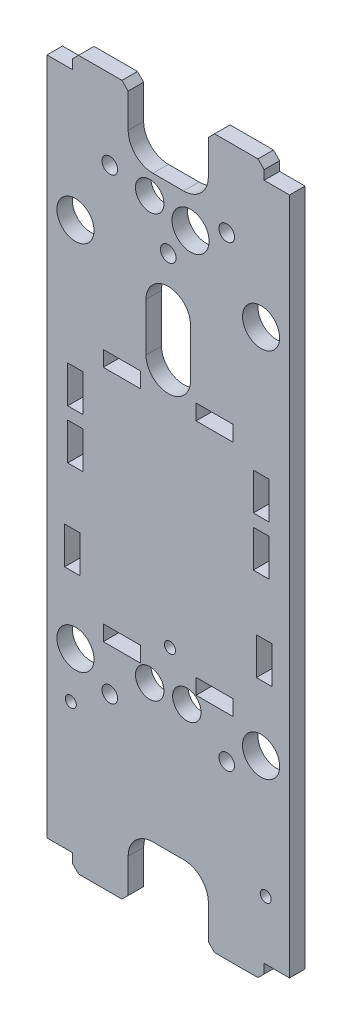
from build123d import *

# Parameters (mm, degrees)
SKETCH1_W                 = 49.784
SKETCH1_H                 = 145.542
BOSS_EXTRUDE1_DEPTH       = 3.175
SKETCH2_W                 = 16.4592
SKETCH2_H                 = 6.35
SKETCH2_W_2               = 10.414
CUT_EXTRUDE1_DEPTH        = 77.976039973
CUT_EXTRUDE2_DEPTH        = 77.976039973
M3_CLEARANCE_HOLE1_D      = 3.2
TAP_DRILL_FOR_4_40_TAP1_D = 2.2606
F_2_CLEARANCE_HOLE1_D     = 2.2606
SKETCH9_W                 = 3.175
SKETCH9_H                 = 7.62
SKETCH9_W_2               = 7.62
SKETCH9_H_2               = 3.175
CUT_EXTRUDE3_DEPTH        = 77.976039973
CUT_EXTRUDE4_DEPTH        = 77.976039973
SKETCH11_R                = 3.81
SKETCH11_R_2              = 2.921
CUT_EXTRUDE5_DEPTH        = 77.976039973
SKETCH12_R                = 3.81
CUT_EXTRUDE6_DEPTH        = 77.976039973
SKETCH13_W                = 3.175
SKETCH13_H                = 7.62
SKETCH13_W_2              = 7.62
SKETCH13_H_2              = 3.175
CUT_EXTRUDE7_DEPTH        = 77.976039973
CHAMFER1_SIZE             = 1.27


with BuildPart() as part:
    # Sketch1 → Boss-Extrude1 (new body)
    with BuildSketch(Plane.XY):
        Rectangle(SKETCH1_W, SKETCH1_H)
    extrude(amount=BOSS_EXTRUDE1_DEPTH)

    # Sketch2 → Cut-Extrude1 (cut, through all)
    with BuildSketch(Plane(origin=(0, 0, 0), x_dir=(-1, 0, 0), z_dir=(0, 0, -1))):
        with Locations((0, 72.771)):
            Rectangle(SKETCH2_W, SKETCH2_H)
        with Locations((-24.892, 72.771)):
            Rectangle(SKETCH2_W_2, SKETCH2_H)
        with Locations((24.892, 72.771)):
            Rectangle(SKETCH2_W_2, SKETCH2_H)
        with Locations((24.892, -72.771)):
            Rectangle(SKETCH2_W_2, SKETCH2_H)
        with Locations((-24.892, -72.771)):
            Rectangle(SKETCH2_W_2, SKETCH2_H)
        with Locations((0, -72.771)):
            Rectangle(SKETCH2_W, SKETCH2_H)
    extrude(amount=-CUT_EXTRUDE1_DEPTH, mode=Mode.SUBTRACT)

    # Sketch3 → Cut-Extrude2 (cut, through all)
    with BuildSketch(Plane(origin=(0, 0, 0), x_dir=(-1, 0, 0), z_dir=(0, 0, -1))):
        with BuildLine():
            Line((-8.2296, 79.756), (8.2296, 79.756))
            Line((8.2296, 79.756), (8.2296, 64.516))
            ThreePointArc((8.2296, 64.516), (6.741702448, 60.923897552), (3.1496, 59.436))
            Line((3.1496, 59.436), (-3.1496, 59.436))
            ThreePointArc((-3.1496, 59.436), (-6.741702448, 60.923897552), (-8.2296, 64.516))
            Line((-8.2296, 64.516), (-8.2296, 79.756))
        make_face()
        with BuildLine():
            Line((8.2296, -79.756), (8.2296, -64.516))
            ThreePointArc((8.2296, -64.516), (6.741702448, -60.923897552), (3.1496, -59.436))
            Line((3.1496, -59.436), (-3.1496, -59.436))
            ThreePointArc((-3.1496, -59.436), (-6.741702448, -60.923897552), (-8.2296, -64.516))
            Line((-8.2296, -64.516), (-8.2296, -79.756))
            Line((-8.2296, -79.756), (8.2296, -79.756))
        make_face()
    extrude(amount=-CUT_EXTRUDE2_DEPTH, mode=Mode.SUBTRACT)

    # M3 Clearance Hole1 (through all)
    with Locations(Plane.XY.offset(3.175)):
        with Locations((0, 46.736), (-12, 56.436), (12, 56.436), (12, -37.564), (-12, -37.564)):
            Hole(M3_CLEARANCE_HOLE1_D / 2)

    # Tap Drill for _4-40 Tap1 (through all)
    with Locations(Plane.XY.offset(3.175)):
        with Locations((0.35153888, -23.114)):
            Hole(TAP_DRILL_FOR_4_40_TAP1_D / 2)

    # 2 Clearance Hole1 (through all)
    with Locations(Plane.XY.offset(3.175)):
        with Locations((20.005, -57.526), (-20.005, -42.91600002)):
            Hole(F_2_CLEARANCE_HOLE1_D / 2)

    # Sketch9 → Cut-Extrude3 (cut, through all)
    with BuildSketch(Plane.XY.offset(3.175)):
        with Locations((-19.05, 13.165289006)):
            Rectangle(SKETCH9_W, SKETCH9_H)
        with Locations((-9.525, 21.432432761)):
            Rectangle(SKETCH9_W_2, SKETCH9_H_2)
        with Locations((19.05, 13.165289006)):
            Rectangle(SKETCH9_W, SKETCH9_H)
        with Locations((19.05, 3.005289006)):
            Rectangle(SKETCH9_W, SKETCH9_H)
        with Locations((-19.05, 3.005289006)):
            Rectangle(SKETCH9_W, SKETCH9_H)
        with Locations((9.525, 21.432432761)):
            Rectangle(SKETCH9_W_2, SKETCH9_H_2)
    extrude(amount=-CUT_EXTRUDE3_DEPTH, mode=Mode.SUBTRACT)

    # Sketch10 → Cut-Extrude4 (cut, through all)
    with BuildSketch(Plane.XY.offset(3.175)):
        with BuildLine():
            Line((4.572, 36.322), (4.572, 26.416))
            ThreePointArc((4.572, 26.416), (0, 21.844), (-4.572, 26.416))
            Line((-4.572, 26.416), (-4.572, 36.322))
            ThreePointArc((-4.572, 36.322), (0, 40.894), (4.572, 36.322))
        make_face()
    extrude(amount=-CUT_EXTRUDE4_DEPTH, mode=Mode.SUBTRACT)

    # Sketch11 → Cut-Extrude5 (cut, through all)
    with BuildSketch(Plane.XY.offset(3.175)):
        with Locations((4.572, 53.086)):
            Circle(SKETCH11_R)
        with Locations((-3.81, 55.118)):
            Circle(SKETCH11_R_2)
        with Locations((3.81, -31.496)):
            Circle(SKETCH11_R_2)
        with Locations((-3.81, -31.496)):
            Circle(SKETCH11_R_2)
    extrude(amount=-CUT_EXTRUDE5_DEPTH, mode=Mode.SUBTRACT)

    # Sketch12 → Cut-Extrude6 (cut, through all)
    with BuildSketch(Plane.XY.offset(3.175)):
        with Locations((19.05, 43.18)):
            Circle(SKETCH12_R)
        with Locations((-19.05, 43.18)):
            Circle(SKETCH12_R)
        with Locations((19.05, -33.02)):
            Circle(SKETCH12_R)
        with Locations((-19.05, -33.02)):
            Circle(SKETCH12_R)
    extrude(amount=-CUT_EXTRUDE6_DEPTH, mode=Mode.SUBTRACT)

    # Sketch13 → Cut-Extrude7 (cut, through all)
    with BuildSketch(Plane.XY.offset(3.175)):
        with Locations((-19.685, -15.785564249)):
            Rectangle(SKETCH13_W, SKETCH13_H)
        with Locations((9.525, -27.335977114)):
            Rectangle(SKETCH13_W_2, SKETCH13_H_2)
        with Locations((19.685, -15.785564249)):
            Rectangle(SKETCH13_W, SKETCH13_H)
        with Locations((-9.525, -27.335977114)):
            Rectangle(SKETCH13_W_2, SKETCH13_H_2)
    extrude(amount=-CUT_EXTRUDE7_DEPTH, mode=Mode.SUBTRACT)

    # Chamfer1
    chamfer1_edges = [part.edges().sort_by_distance(p)[0] for p in [
        (19.685, 72.771, 1.5875),
        (-19.685, 72.771, 1.5875),
        (-19.685, -72.771, 1.5875),
        (19.685, -72.771, 1.5875),
        (8.2296, -72.771, 1.5875),
        (-8.2296, -72.771, 1.5875),
        (-8.2296, 72.771, 1.5875),
        (8.2296, 72.771, 1.5875),
    ]]
    chamfer(chamfer1_edges, length=CHAMFER1_SIZE)


solid = part.part
